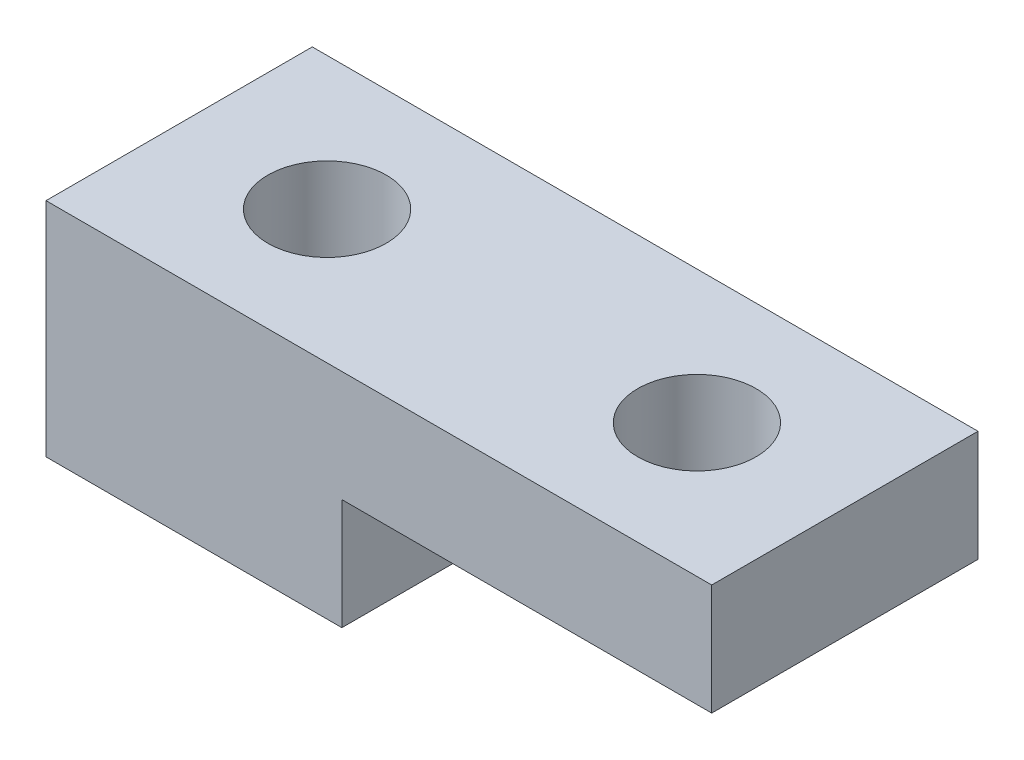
from build123d import *

# Parameters (mm, degrees)
EXTRUSION1_DEPTH        = 9
ESQUISSE2_R             = 4
ENL_V_MAT_EXTRU_1_DEPTH = 49.280430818


with BuildPart() as part:
    # Esquisse1 → Extrusion1 (new, symmetric)
    with BuildSketch(Plane.XY):
        Polygon((0, 0), (0, 15), (45, 15), (45, 7.5), (20, 7.5), (20, 0), align=None)
    extrude(amount=EXTRUSION1_DEPTH, both=True)

    # Esquisse2 → Enl_v. mat.-Extru.1 (cut, through all)
    with BuildSketch(Plane(origin=(0, 15, 0), x_dir=(-1, 0, 0), z_dir=(0, 1, 0))):
        with Locations(Location((-10, 0, 0), (0, 0, 90))):
            Circle(ESQUISSE2_R)
        with Locations(Location((-35, 0, 0), (0, 0, 90))):
            Circle(ESQUISSE2_R)
    extrude(amount=-ENL_V_MAT_EXTRU_1_DEPTH, mode=Mode.SUBTRACT)


solid = part.part
